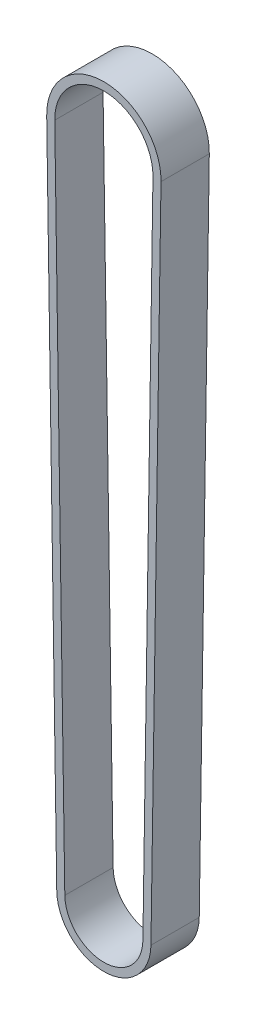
from build123d import *

# Parameters (mm, degrees)
EXTRUDE_1_DEPTH = 6


with BuildPart() as part:
    # Sketch 1 → Extrude 1 (new body)
    with BuildSketch(Plane.XY):
        with BuildLine():
            Line((-7.099190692, 82.683145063), (-5.849333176, -0.088325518))
            ThreePointArc((-5.849333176, -0.088325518), (0, -5.85), (5.849333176, -0.088325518))
            Line((5.849333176, -0.088325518), (7.099190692, 82.683145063))
            ThreePointArc((7.099190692, 82.683145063), (0, 89.890343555), (-7.099190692, 82.683145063))
        make_face()
        with BuildLine():
            Line((6.099304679, 82.698243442), (4.849447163, -0.073227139))
            ThreePointArc((4.849447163, -0.073227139), (0, -4.85), (-4.849447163, -0.073227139))
            Line((-4.849447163, -0.073227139), (-6.099304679, 82.698243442))
            ThreePointArc((-6.099304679, 82.698243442), (0, 88.890343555), (6.099304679, 82.698243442))
        make_face(mode=Mode.SUBTRACT)
    extrude(amount=EXTRUDE_1_DEPTH)


solid = part.part
